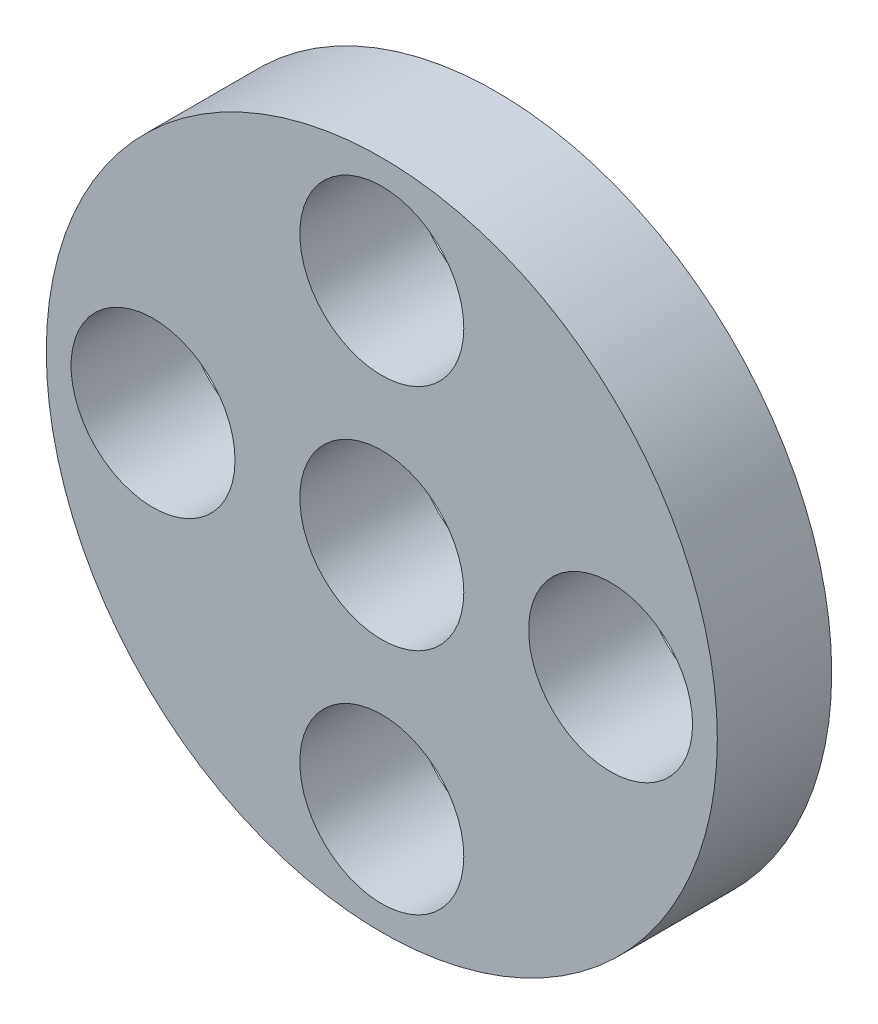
ISO-10303-21;
HEADER;
FILE_DESCRIPTION(('STEP AP214'),'2;1');
FILE_NAME('part.step','',(''),(''),'','','');
FILE_SCHEMA(('AUTOMOTIVE_DESIGN { 1 0 10303 214 1 1 1 1 }'));
ENDSEC;
DATA;
#1=APPLICATION_CONTEXT('core data for automotive mechanical design processes');
#2=APPLICATION_PROTOCOL_DEFINITION('international standard','automotive_design',2000,#1);
#3=PRODUCT_CONTEXT('',#1,'mechanical');
#4=PRODUCT('Part','Part','',(#3));
#5=PRODUCT_RELATED_PRODUCT_CATEGORY('part','',(#4));
#6=PRODUCT_DEFINITION_FORMATION('','',#4);
#7=PRODUCT_DEFINITION_CONTEXT('part definition',#1,'design');
#8=PRODUCT_DEFINITION('design','',#6,#7);
#9=PRODUCT_DEFINITION_SHAPE('','',#8);
#10=(LENGTH_UNIT() NAMED_UNIT(*) SI_UNIT(.MILLI.,.METRE.));
#11=(NAMED_UNIT(*) PLANE_ANGLE_UNIT() SI_UNIT($,.RADIAN.));
#12=(NAMED_UNIT(*) SI_UNIT($,.STERADIAN.) SOLID_ANGLE_UNIT());
#13=UNCERTAINTY_MEASURE_WITH_UNIT(LENGTH_MEASURE(1.E-05),#10,'distance_accuracy_value','');
#14=(GEOMETRIC_REPRESENTATION_CONTEXT(3) GLOBAL_UNCERTAINTY_ASSIGNED_CONTEXT((#13)) GLOBAL_UNIT_ASSIGNED_CONTEXT((#10,
#11,#12)) REPRESENTATION_CONTEXT('',''));
#15=CARTESIAN_POINT('',(0.,0.,0.));
#16=DIRECTION('',(0.,0.,1.));
#17=DIRECTION('',(1.,0.,0.));
#18=AXIS2_PLACEMENT_3D('',#15,#16,#17);
#19=CARTESIAN_POINT('',(0.,0.,3.));
#20=DIRECTION('',(0.,0.,1.));
#21=DIRECTION('',(1.,0.,0.));
#22=AXIS2_PLACEMENT_3D('',#19,#20,#21);
#23=PLANE('',#22);
#24=CARTESIAN_POINT('',(-6.,0.,3.));
#25=DIRECTION('',(0.,0.,1.));
#26=DIRECTION('',(1.,0.,0.));
#27=AXIS2_PLACEMENT_3D('',#24,#25,#26);
#28=CIRCLE('',#27,2.15);
#29=CARTESIAN_POINT('',(-3.85,0.,3.));
#30=VERTEX_POINT('',#29);
#31=EDGE_CURVE('E58',#30,#30,#28,.T.);
#32=ORIENTED_EDGE('',*,*,#31,.F.);
#33=EDGE_LOOP('',(#32));
#34=FACE_BOUND('',#33,.T.);
#35=CARTESIAN_POINT('',(6.,0.,3.));
#36=DIRECTION('',(0.,0.,1.));
#37=DIRECTION('',(1.,0.,0.));
#38=AXIS2_PLACEMENT_3D('',#35,#36,#37);
#39=CIRCLE('',#38,2.15);
#40=CARTESIAN_POINT('',(8.15,0.,3.));
#41=VERTEX_POINT('',#40);
#42=EDGE_CURVE('E46',#41,#41,#39,.T.);
#43=ORIENTED_EDGE('',*,*,#42,.F.);
#44=EDGE_LOOP('',(#43));
#45=FACE_BOUND('',#44,.T.);
#46=CARTESIAN_POINT('',(0.,0.,3.));
#47=DIRECTION('',(0.,0.,1.));
#48=DIRECTION('',(1.,0.,0.));
#49=AXIS2_PLACEMENT_3D('',#46,#47,#48);
#50=CIRCLE('',#49,8.8);
#51=CARTESIAN_POINT('',(8.8,0.,3.));
#52=VERTEX_POINT('',#51);
#53=EDGE_CURVE('E10',#52,#52,#50,.T.);
#54=ORIENTED_EDGE('',*,*,#53,.T.);
#55=EDGE_LOOP('',(#54));
#56=FACE_BOUND('',#55,.T.);
#57=CARTESIAN_POINT('',(0.,6.,3.));
#58=DIRECTION('',(0.,0.,1.));
#59=DIRECTION('',(1.,0.,0.));
#60=AXIS2_PLACEMENT_3D('',#57,#58,#59);
#61=CIRCLE('',#60,2.15);
#62=CARTESIAN_POINT('',(2.15,6.,3.));
#63=VERTEX_POINT('',#62);
#64=EDGE_CURVE('E41',#63,#63,#61,.T.);
#65=ORIENTED_EDGE('',*,*,#64,.F.);
#66=EDGE_LOOP('',(#65));
#67=FACE_BOUND('',#66,.T.);
#68=CARTESIAN_POINT('',(0.,-6.,3.));
#69=DIRECTION('',(0.,0.,1.));
#70=DIRECTION('',(1.,0.,0.));
#71=AXIS2_PLACEMENT_3D('',#68,#69,#70);
#72=CIRCLE('',#71,2.15);
#73=CARTESIAN_POINT('',(2.15,-6.,3.));
#74=VERTEX_POINT('',#73);
#75=EDGE_CURVE('E52',#74,#74,#72,.T.);
#76=ORIENTED_EDGE('',*,*,#75,.F.);
#77=EDGE_LOOP('',(#76));
#78=FACE_BOUND('',#77,.T.);
#79=CARTESIAN_POINT('',(0.,0.,3.));
#80=DIRECTION('',(0.,0.,1.));
#81=DIRECTION('',(1.,0.,0.));
#82=AXIS2_PLACEMENT_3D('',#79,#80,#81);
#83=CIRCLE('',#82,2.15);
#84=CARTESIAN_POINT('',(2.15,0.,3.));
#85=VERTEX_POINT('',#84);
#86=EDGE_CURVE('E64',#85,#85,#83,.T.);
#87=ORIENTED_EDGE('',*,*,#86,.F.);
#88=EDGE_LOOP('',(#87));
#89=FACE_BOUND('',#88,.T.);
#90=ADVANCED_FACE('F30',(#34,#45,#56,#67,#78,#89),#23,.T.);
#91=CARTESIAN_POINT('',(0.,0.,0.));
#92=DIRECTION('',(0.,0.,1.));
#93=DIRECTION('',(1.,0.,0.));
#94=AXIS2_PLACEMENT_3D('',#91,#92,#93);
#95=PLANE('',#94);
#96=CARTESIAN_POINT('',(0.,0.,0.));
#97=DIRECTION('',(0.,0.,1.));
#98=DIRECTION('',(1.,0.,0.));
#99=AXIS2_PLACEMENT_3D('',#96,#97,#98);
#100=CIRCLE('',#99,8.8);
#101=CARTESIAN_POINT('',(8.8,0.,0.));
#102=VERTEX_POINT('',#101);
#103=EDGE_CURVE('E34',#102,#102,#100,.T.);
#104=ORIENTED_EDGE('',*,*,#103,.F.);
#105=EDGE_LOOP('',(#104));
#106=FACE_BOUND('',#105,.T.);
#107=CARTESIAN_POINT('',(0.,6.,0.));
#108=DIRECTION('',(0.,0.,1.));
#109=DIRECTION('',(1.,0.,0.));
#110=AXIS2_PLACEMENT_3D('',#107,#108,#109);
#111=CIRCLE('',#110,2.15);
#112=CARTESIAN_POINT('',(2.15,6.,0.));
#113=VERTEX_POINT('',#112);
#114=EDGE_CURVE('E43',#113,#113,#111,.T.);
#115=ORIENTED_EDGE('',*,*,#114,.T.);
#116=EDGE_LOOP('',(#115));
#117=FACE_BOUND('',#116,.T.);
#118=CARTESIAN_POINT('',(6.,0.,0.));
#119=DIRECTION('',(0.,0.,1.));
#120=DIRECTION('',(1.,0.,0.));
#121=AXIS2_PLACEMENT_3D('',#118,#119,#120);
#122=CIRCLE('',#121,2.15);
#123=CARTESIAN_POINT('',(8.15,0.,0.));
#124=VERTEX_POINT('',#123);
#125=EDGE_CURVE('E49',#124,#124,#122,.T.);
#126=ORIENTED_EDGE('',*,*,#125,.T.);
#127=EDGE_LOOP('',(#126));
#128=FACE_BOUND('',#127,.T.);
#129=CARTESIAN_POINT('',(0.,-6.,0.));
#130=DIRECTION('',(0.,0.,1.));
#131=DIRECTION('',(1.,0.,0.));
#132=AXIS2_PLACEMENT_3D('',#129,#130,#131);
#133=CIRCLE('',#132,2.15);
#134=CARTESIAN_POINT('',(2.15,-6.,0.));
#135=VERTEX_POINT('',#134);
#136=EDGE_CURVE('E55',#135,#135,#133,.T.);
#137=ORIENTED_EDGE('',*,*,#136,.T.);
#138=EDGE_LOOP('',(#137));
#139=FACE_BOUND('',#138,.T.);
#140=CARTESIAN_POINT('',(-6.,0.,0.));
#141=DIRECTION('',(0.,0.,1.));
#142=DIRECTION('',(1.,0.,0.));
#143=AXIS2_PLACEMENT_3D('',#140,#141,#142);
#144=CIRCLE('',#143,2.15);
#145=CARTESIAN_POINT('',(-3.85,0.,0.));
#146=VERTEX_POINT('',#145);
#147=EDGE_CURVE('E61',#146,#146,#144,.T.);
#148=ORIENTED_EDGE('',*,*,#147,.T.);
#149=EDGE_LOOP('',(#148));
#150=FACE_BOUND('',#149,.T.);
#151=CARTESIAN_POINT('',(0.,0.,0.));
#152=DIRECTION('',(0.,0.,1.));
#153=DIRECTION('',(1.,0.,0.));
#154=AXIS2_PLACEMENT_3D('',#151,#152,#153);
#155=CIRCLE('',#154,2.15);
#156=CARTESIAN_POINT('',(2.15,0.,0.));
#157=VERTEX_POINT('',#156);
#158=EDGE_CURVE('E67',#157,#157,#155,.T.);
#159=ORIENTED_EDGE('',*,*,#158,.T.);
#160=EDGE_LOOP('',(#159));
#161=FACE_BOUND('',#160,.T.);
#162=ADVANCED_FACE('F77',(#106,#117,#128,#139,#150,#161),#95,.F.);
#163=CARTESIAN_POINT('',(0.,0.,3.));
#164=DIRECTION('',(0.,0.,-1.));
#165=DIRECTION('',(-1.,0.,0.));
#166=AXIS2_PLACEMENT_3D('',#163,#164,#165);
#167=CYLINDRICAL_SURFACE('',#166,8.8);
#168=ORIENTED_EDGE('',*,*,#53,.F.);
#169=EDGE_LOOP('',(#168));
#170=FACE_BOUND('',#169,.T.);
#171=ORIENTED_EDGE('',*,*,#103,.T.);
#172=EDGE_LOOP('',(#171));
#173=FACE_BOUND('',#172,.T.);
#174=ADVANCED_FACE('F32',(#170,#173),#167,.T.);
#175=CARTESIAN_POINT('',(0.,6.,3.));
#176=DIRECTION('',(0.,0.,-1.));
#177=DIRECTION('',(-1.,0.,0.));
#178=AXIS2_PLACEMENT_3D('',#175,#176,#177);
#179=CYLINDRICAL_SURFACE('',#178,2.15);
#180=ORIENTED_EDGE('',*,*,#64,.T.);
#181=EDGE_LOOP('',(#180));
#182=FACE_BOUND('',#181,.T.);
#183=ORIENTED_EDGE('',*,*,#114,.F.);
#184=EDGE_LOOP('',(#183));
#185=FACE_BOUND('',#184,.T.);
#186=ADVANCED_FACE('F87',(#182,#185),#179,.F.);
#187=CARTESIAN_POINT('',(6.,0.,3.));
#188=DIRECTION('',(0.,0.,-1.));
#189=DIRECTION('',(-1.,0.,0.));
#190=AXIS2_PLACEMENT_3D('',#187,#188,#189);
#191=CYLINDRICAL_SURFACE('',#190,2.15);
#192=ORIENTED_EDGE('',*,*,#42,.T.);
#193=EDGE_LOOP('',(#192));
#194=FACE_BOUND('',#193,.T.);
#195=ORIENTED_EDGE('',*,*,#125,.F.);
#196=EDGE_LOOP('',(#195));
#197=FACE_BOUND('',#196,.T.);
#198=ADVANCED_FACE('F90',(#194,#197),#191,.F.);
#199=CARTESIAN_POINT('',(0.,-6.,3.));
#200=DIRECTION('',(0.,0.,-1.));
#201=DIRECTION('',(-1.,0.,0.));
#202=AXIS2_PLACEMENT_3D('',#199,#200,#201);
#203=CYLINDRICAL_SURFACE('',#202,2.15);
#204=ORIENTED_EDGE('',*,*,#75,.T.);
#205=EDGE_LOOP('',(#204));
#206=FACE_BOUND('',#205,.T.);
#207=ORIENTED_EDGE('',*,*,#136,.F.);
#208=EDGE_LOOP('',(#207));
#209=FACE_BOUND('',#208,.T.);
#210=ADVANCED_FACE('F94',(#206,#209),#203,.F.);
#211=CARTESIAN_POINT('',(-6.,0.,3.));
#212=DIRECTION('',(0.,0.,-1.));
#213=DIRECTION('',(-1.,0.,0.));
#214=AXIS2_PLACEMENT_3D('',#211,#212,#213);
#215=CYLINDRICAL_SURFACE('',#214,2.15);
#216=ORIENTED_EDGE('',*,*,#31,.T.);
#217=EDGE_LOOP('',(#216));
#218=FACE_BOUND('',#217,.T.);
#219=ORIENTED_EDGE('',*,*,#147,.F.);
#220=EDGE_LOOP('',(#219));
#221=FACE_BOUND('',#220,.T.);
#222=ADVANCED_FACE('F98',(#218,#221),#215,.F.);
#223=CARTESIAN_POINT('',(0.,0.,3.));
#224=DIRECTION('',(0.,0.,-1.));
#225=DIRECTION('',(-1.,0.,0.));
#226=AXIS2_PLACEMENT_3D('',#223,#224,#225);
#227=CYLINDRICAL_SURFACE('',#226,2.15);
#228=ORIENTED_EDGE('',*,*,#86,.T.);
#229=EDGE_LOOP('',(#228));
#230=FACE_BOUND('',#229,.T.);
#231=ORIENTED_EDGE('',*,*,#158,.F.);
#232=EDGE_LOOP('',(#231));
#233=FACE_BOUND('',#232,.T.);
#234=ADVANCED_FACE('F73',(#230,#233),#227,.F.);
#235=CLOSED_SHELL('',(#90,#162,#174,#186,#198,#210,#222,#234));
#236=MANIFOLD_SOLID_BREP('B2',#235);
#237=ADVANCED_BREP_SHAPE_REPRESENTATION('',(#18,#236),#14);
#238=SHAPE_DEFINITION_REPRESENTATION(#9,#237);
ENDSEC;
END-ISO-10303-21;
